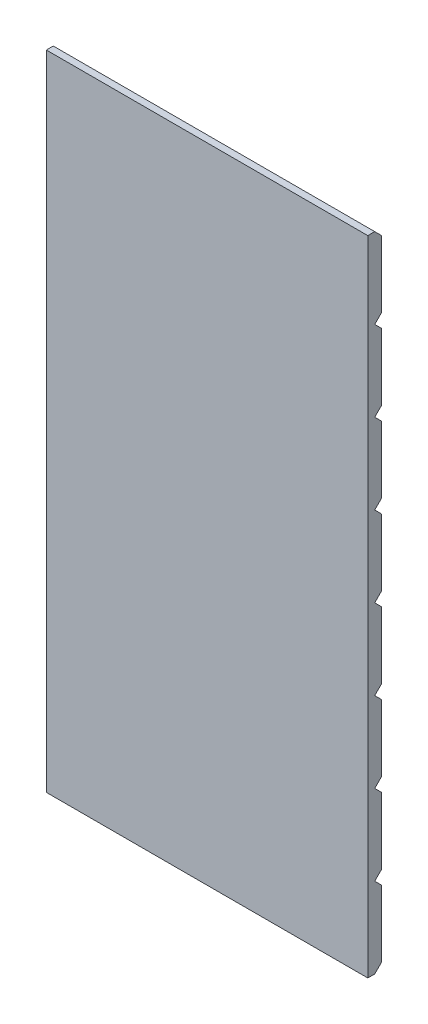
ISO-10303-21;
HEADER;
FILE_DESCRIPTION(('STEP AP214'),'2;1');
FILE_NAME('part.step','',(''),(''),'','','');
FILE_SCHEMA(('AUTOMOTIVE_DESIGN { 1 0 10303 214 1 1 1 1 }'));
ENDSEC;
DATA;
#1=APPLICATION_CONTEXT('core data for automotive mechanical design processes');
#2=APPLICATION_PROTOCOL_DEFINITION('international standard','automotive_design',2000,#1);
#3=PRODUCT_CONTEXT('',#1,'mechanical');
#4=PRODUCT('Part','Part','',(#3));
#5=PRODUCT_RELATED_PRODUCT_CATEGORY('part','',(#4));
#6=PRODUCT_DEFINITION_FORMATION('','',#4);
#7=PRODUCT_DEFINITION_CONTEXT('part definition',#1,'design');
#8=PRODUCT_DEFINITION('design','',#6,#7);
#9=PRODUCT_DEFINITION_SHAPE('','',#8);
#10=(LENGTH_UNIT() NAMED_UNIT(*) SI_UNIT(.MILLI.,.METRE.));
#11=(NAMED_UNIT(*) PLANE_ANGLE_UNIT() SI_UNIT($,.RADIAN.));
#12=(NAMED_UNIT(*) SI_UNIT($,.STERADIAN.) SOLID_ANGLE_UNIT());
#13=UNCERTAINTY_MEASURE_WITH_UNIT(LENGTH_MEASURE(1.E-05),#10,'distance_accuracy_value','');
#14=(GEOMETRIC_REPRESENTATION_CONTEXT(3) GLOBAL_UNCERTAINTY_ASSIGNED_CONTEXT((#13)) GLOBAL_UNIT_ASSIGNED_CONTEXT((#10,
#11,#12)) REPRESENTATION_CONTEXT('',''));
#15=CARTESIAN_POINT('',(0.,0.,0.));
#16=DIRECTION('',(0.,0.,1.));
#17=DIRECTION('',(1.,0.,0.));
#18=AXIS2_PLACEMENT_3D('',#15,#16,#17);
#19=CARTESIAN_POINT('',(0.,0.,0.));
#20=DIRECTION('',(0.,0.,1.));
#21=DIRECTION('',(1.,0.,0.));
#22=AXIS2_PLACEMENT_3D('',#19,#20,#21);
#23=PLANE('',#22);
#24=DIRECTION('',(0.,1.,0.));
#25=VECTOR('',#24,1.);
#26=CARTESIAN_POINT('',(290.,580.,0.));
#27=LINE('',#26,#25);
#28=CARTESIAN_POINT('',(290.,-567.5,0.));
#29=VERTEX_POINT('',#28);
#30=CARTESIAN_POINT('',(290.,-447.5,0.));
#31=VERTEX_POINT('',#30);
#32=EDGE_CURVE('E273',#29,#31,#27,.T.);
#33=ORIENTED_EDGE('',*,*,#32,.F.);
#34=DIRECTION('',(-1.,0.,0.));
#35=VECTOR('',#34,1.);
#36=CARTESIAN_POINT('',(0.,-567.5,0.));
#37=LINE('',#36,#35);
#38=CARTESIAN_POINT('',(-290.,-567.5,0.));
#39=VERTEX_POINT('',#38);
#40=EDGE_CURVE('E47',#29,#39,#37,.T.);
#41=ORIENTED_EDGE('',*,*,#40,.T.);
#42=DIRECTION('',(0.,-1.,0.));
#43=VECTOR('',#42,1.);
#44=CARTESIAN_POINT('',(-290.,580.,0.));
#45=LINE('',#44,#43);
#46=CARTESIAN_POINT('',(-290.,-447.5,0.));
#47=VERTEX_POINT('',#46);
#48=EDGE_CURVE('E304',#47,#39,#45,.T.);
#49=ORIENTED_EDGE('',*,*,#48,.F.);
#50=DIRECTION('',(1.,0.,0.));
#51=VECTOR('',#50,1.);
#52=CARTESIAN_POINT('',(0.,-447.5,0.));
#53=LINE('',#52,#51);
#54=EDGE_CURVE('E391',#47,#31,#53,.T.);
#55=ORIENTED_EDGE('',*,*,#54,.T.);
#56=EDGE_LOOP('',(#33,#41,#49,#55));
#57=FACE_BOUND('',#56,.T.);
#58=ADVANCED_FACE('F32',(#57),#23,.F.);
#59=CARTESIAN_POINT('',(290.,-422.5,0.));
#60=VERTEX_POINT('',#59);
#61=CARTESIAN_POINT('',(290.,-302.5,0.));
#62=VERTEX_POINT('',#61);
#63=EDGE_CURVE('E261',#60,#62,#27,.T.);
#64=ORIENTED_EDGE('',*,*,#63,.F.);
#65=DIRECTION('',(-1.,0.,0.));
#66=VECTOR('',#65,1.);
#67=CARTESIAN_POINT('',(0.,-422.5,0.));
#68=LINE('',#67,#66);
#69=CARTESIAN_POINT('',(-290.,-422.5,0.));
#70=VERTEX_POINT('',#69);
#71=EDGE_CURVE('E54',#60,#70,#68,.T.);
#72=ORIENTED_EDGE('',*,*,#71,.T.);
#73=CARTESIAN_POINT('',(-290.,-302.5,0.));
#74=VERTEX_POINT('',#73);
#75=EDGE_CURVE('E410',#74,#70,#45,.T.);
#76=ORIENTED_EDGE('',*,*,#75,.F.);
#77=DIRECTION('',(1.,0.,0.));
#78=VECTOR('',#77,1.);
#79=CARTESIAN_POINT('',(0.,-302.5,0.));
#80=LINE('',#79,#78);
#81=EDGE_CURVE('E272',#74,#62,#80,.T.);
#82=ORIENTED_EDGE('',*,*,#81,.T.);
#83=EDGE_LOOP('',(#64,#72,#76,#82));
#84=FACE_BOUND('',#83,.T.);
#85=ADVANCED_FACE('F269',(#84),#23,.F.);
#86=CARTESIAN_POINT('',(290.,-277.5,0.));
#87=VERTEX_POINT('',#86);
#88=CARTESIAN_POINT('',(290.,-157.5,0.));
#89=VERTEX_POINT('',#88);
#90=EDGE_CURVE('E274',#87,#89,#27,.T.);
#91=ORIENTED_EDGE('',*,*,#90,.F.);
#92=DIRECTION('',(-1.,0.,0.));
#93=VECTOR('',#92,1.);
#94=CARTESIAN_POINT('',(0.,-277.5,0.));
#95=LINE('',#94,#93);
#96=CARTESIAN_POINT('',(-290.,-277.5,0.));
#97=VERTEX_POINT('',#96);
#98=EDGE_CURVE('E381',#87,#97,#95,.T.);
#99=ORIENTED_EDGE('',*,*,#98,.T.);
#100=CARTESIAN_POINT('',(-290.,-157.5,0.));
#101=VERTEX_POINT('',#100);
#102=EDGE_CURVE('E411',#101,#97,#45,.T.);
#103=ORIENTED_EDGE('',*,*,#102,.F.);
#104=DIRECTION('',(1.,0.,0.));
#105=VECTOR('',#104,1.);
#106=CARTESIAN_POINT('',(0.,-157.5,0.));
#107=LINE('',#106,#105);
#108=EDGE_CURVE('E362',#101,#89,#107,.T.);
#109=ORIENTED_EDGE('',*,*,#108,.T.);
#110=EDGE_LOOP('',(#91,#99,#103,#109));
#111=FACE_BOUND('',#110,.T.);
#112=ADVANCED_FACE('F443',(#111),#23,.F.);
#113=CARTESIAN_POINT('',(290.,-132.5,0.));
#114=VERTEX_POINT('',#113);
#115=CARTESIAN_POINT('',(290.,-12.4999999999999,0.));
#116=VERTEX_POINT('',#115);
#117=EDGE_CURVE('E278',#114,#116,#27,.T.);
#118=ORIENTED_EDGE('',*,*,#117,.F.);
#119=DIRECTION('',(-1.,0.,0.));
#120=VECTOR('',#119,1.);
#121=CARTESIAN_POINT('',(0.,-132.5,0.));
#122=LINE('',#121,#120);
#123=CARTESIAN_POINT('',(-290.,-132.5,0.));
#124=VERTEX_POINT('',#123);
#125=EDGE_CURVE('E367',#114,#124,#122,.T.);
#126=ORIENTED_EDGE('',*,*,#125,.T.);
#127=CARTESIAN_POINT('',(-290.,-12.4999999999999,0.));
#128=VERTEX_POINT('',#127);
#129=EDGE_CURVE('E428',#128,#124,#45,.T.);
#130=ORIENTED_EDGE('',*,*,#129,.F.);
#131=DIRECTION('',(1.,0.,0.));
#132=VECTOR('',#131,1.);
#133=CARTESIAN_POINT('',(0.,-12.5,0.));
#134=LINE('',#133,#132);
#135=EDGE_CURVE('E346',#128,#116,#134,.T.);
#136=ORIENTED_EDGE('',*,*,#135,.T.);
#137=EDGE_LOOP('',(#118,#126,#130,#136));
#138=FACE_BOUND('',#137,.T.);
#139=ADVANCED_FACE('F506',(#138),#23,.F.);
#140=CARTESIAN_POINT('',(290.,12.5,0.));
#141=VERTEX_POINT('',#140);
#142=CARTESIAN_POINT('',(290.,132.5,0.));
#143=VERTEX_POINT('',#142);
#144=EDGE_CURVE('E495',#141,#143,#27,.T.);
#145=ORIENTED_EDGE('',*,*,#144,.F.);
#146=DIRECTION('',(-1.,0.,0.));
#147=VECTOR('',#146,1.);
#148=CARTESIAN_POINT('',(0.,12.5,0.));
#149=LINE('',#148,#147);
#150=CARTESIAN_POINT('',(-290.,12.4999999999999,0.));
#151=VERTEX_POINT('',#150);
#152=EDGE_CURVE('E351',#141,#151,#149,.T.);
#153=ORIENTED_EDGE('',*,*,#152,.T.);
#154=CARTESIAN_POINT('',(-290.,132.5,0.));
#155=VERTEX_POINT('',#154);
#156=EDGE_CURVE('E423',#155,#151,#45,.T.);
#157=ORIENTED_EDGE('',*,*,#156,.F.);
#158=DIRECTION('',(1.,0.,0.));
#159=VECTOR('',#158,1.);
#160=CARTESIAN_POINT('',(0.,132.5,0.));
#161=LINE('',#160,#159);
#162=EDGE_CURVE('E330',#155,#143,#161,.T.);
#163=ORIENTED_EDGE('',*,*,#162,.T.);
#164=EDGE_LOOP('',(#145,#153,#157,#163));
#165=FACE_BOUND('',#164,.T.);
#166=ADVANCED_FACE('F490',(#165),#23,.F.);
#167=CARTESIAN_POINT('',(290.,157.5,0.));
#168=VERTEX_POINT('',#167);
#169=CARTESIAN_POINT('',(290.,277.5,0.));
#170=VERTEX_POINT('',#169);
#171=EDGE_CURVE('E494',#168,#170,#27,.T.);
#172=ORIENTED_EDGE('',*,*,#171,.F.);
#173=DIRECTION('',(-1.,0.,0.));
#174=VECTOR('',#173,1.);
#175=CARTESIAN_POINT('',(0.,157.5,0.));
#176=LINE('',#175,#174);
#177=CARTESIAN_POINT('',(-290.,157.5,0.));
#178=VERTEX_POINT('',#177);
#179=EDGE_CURVE('E335',#168,#178,#176,.T.);
#180=ORIENTED_EDGE('',*,*,#179,.T.);
#181=CARTESIAN_POINT('',(-290.,277.5,0.));
#182=VERTEX_POINT('',#181);
#183=EDGE_CURVE('E418',#182,#178,#45,.T.);
#184=ORIENTED_EDGE('',*,*,#183,.F.);
#185=DIRECTION('',(1.,0.,0.));
#186=VECTOR('',#185,1.);
#187=CARTESIAN_POINT('',(0.,277.5,0.));
#188=LINE('',#187,#186);
#189=EDGE_CURVE('E314',#182,#170,#188,.T.);
#190=ORIENTED_EDGE('',*,*,#189,.T.);
#191=EDGE_LOOP('',(#172,#180,#184,#190));
#192=FACE_BOUND('',#191,.T.);
#193=ADVANCED_FACE('F484',(#192),#23,.F.);
#194=CARTESIAN_POINT('',(290.,302.5,0.));
#195=VERTEX_POINT('',#194);
#196=CARTESIAN_POINT('',(290.,422.5,0.));
#197=VERTEX_POINT('',#196);
#198=EDGE_CURVE('E416',#195,#197,#27,.T.);
#199=ORIENTED_EDGE('',*,*,#198,.F.);
#200=DIRECTION('',(-1.,0.,0.));
#201=VECTOR('',#200,1.);
#202=CARTESIAN_POINT('',(0.,302.5,0.));
#203=LINE('',#202,#201);
#204=CARTESIAN_POINT('',(-290.,302.5,0.));
#205=VERTEX_POINT('',#204);
#206=EDGE_CURVE('E319',#195,#205,#203,.T.);
#207=ORIENTED_EDGE('',*,*,#206,.T.);
#208=CARTESIAN_POINT('',(-290.,422.5,0.));
#209=VERTEX_POINT('',#208);
#210=EDGE_CURVE('E413',#209,#205,#45,.T.);
#211=ORIENTED_EDGE('',*,*,#210,.F.);
#212=DIRECTION('',(1.,0.,0.));
#213=VECTOR('',#212,1.);
#214=CARTESIAN_POINT('',(0.,422.5,0.));
#215=LINE('',#214,#213);
#216=EDGE_CURVE('E241',#209,#197,#215,.T.);
#217=ORIENTED_EDGE('',*,*,#216,.T.);
#218=EDGE_LOOP('',(#199,#207,#211,#217));
#219=FACE_BOUND('',#218,.T.);
#220=ADVANCED_FACE('F473',(#219),#23,.F.);
#221=CARTESIAN_POINT('',(-290.,580.,25.));
#222=DIRECTION('',(1.,0.,0.));
#223=DIRECTION('',(0.,0.,-1.));
#224=AXIS2_PLACEMENT_3D('',#221,#222,#223);
#225=PLANE('',#224);
#226=ORIENTED_EDGE('',*,*,#48,.T.);
#227=DIRECTION('',(0.,0.707106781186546,-0.707106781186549));
#228=VECTOR('',#227,1.);
#229=CARTESIAN_POINT('',(-290.,-580.,12.5));
#230=LINE('',#229,#228);
#231=CARTESIAN_POINT('',(-290.,-580.,12.5));
#232=VERTEX_POINT('',#231);
#233=EDGE_CURVE('E222',#232,#39,#230,.T.);
#234=ORIENTED_EDGE('',*,*,#233,.F.);
#235=DIRECTION('',(0.,0.,-1.));
#236=VECTOR('',#235,1.);
#237=CARTESIAN_POINT('',(-290.,-580.,25.));
#238=LINE('',#237,#236);
#239=CARTESIAN_POINT('',(-290.,-580.,25.));
#240=VERTEX_POINT('',#239);
#241=EDGE_CURVE('E221',#240,#232,#238,.T.);
#242=ORIENTED_EDGE('',*,*,#241,.F.);
#243=DIRECTION('',(0.,-1.,0.));
#244=VECTOR('',#243,1.);
#245=CARTESIAN_POINT('',(-290.,580.,25.));
#246=LINE('',#245,#244);
#247=CARTESIAN_POINT('',(-290.,580.,25.));
#248=VERTEX_POINT('',#247);
#249=EDGE_CURVE('E276',#248,#240,#246,.T.);
#250=ORIENTED_EDGE('',*,*,#249,.F.);
#251=DIRECTION('',(0.,0.,-1.));
#252=VECTOR('',#251,1.);
#253=CARTESIAN_POINT('',(-290.,580.,25.));
#254=LINE('',#253,#252);
#255=CARTESIAN_POINT('',(-290.,580.,12.5));
#256=VERTEX_POINT('',#255);
#257=EDGE_CURVE('E232',#248,#256,#254,.T.);
#258=ORIENTED_EDGE('',*,*,#257,.T.);
#259=DIRECTION('',(0.,0.707106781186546,0.707106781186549));
#260=VECTOR('',#259,1.);
#261=CARTESIAN_POINT('',(-290.,518.918540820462,-48.5814591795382));
#262=LINE('',#261,#260);
#263=CARTESIAN_POINT('',(-290.,567.5,0.));
#264=VERTEX_POINT('',#263);
#265=EDGE_CURVE('E298',#264,#256,#262,.T.);
#266=ORIENTED_EDGE('',*,*,#265,.F.);
#267=CARTESIAN_POINT('',(-290.,447.5,0.));
#268=VERTEX_POINT('',#267);
#269=EDGE_CURVE('E280',#264,#268,#45,.T.);
#270=ORIENTED_EDGE('',*,*,#269,.T.);
#271=DIRECTION('',(0.,0.707106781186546,-0.707106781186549));
#272=VECTOR('',#271,1.);
#273=CARTESIAN_POINT('',(-290.,435.,12.5));
#274=LINE('',#273,#272);
#275=CARTESIAN_POINT('',(-290.,435.,12.5));
#276=VERTEX_POINT('',#275);
#277=EDGE_CURVE('E308',#276,#268,#274,.T.);
#278=ORIENTED_EDGE('',*,*,#277,.F.);
#279=DIRECTION('',(0.,0.707106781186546,0.707106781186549));
#280=VECTOR('',#279,1.);
#281=CARTESIAN_POINT('',(-290.,373.918540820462,-48.5814591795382));
#282=LINE('',#281,#280);
#283=EDGE_CURVE('E302',#209,#276,#282,.T.);
#284=ORIENTED_EDGE('',*,*,#283,.F.);
#285=ORIENTED_EDGE('',*,*,#210,.T.);
#286=DIRECTION('',(0.,0.707106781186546,-0.707106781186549));
#287=VECTOR('',#286,1.);
#288=CARTESIAN_POINT('',(-290.,290.,12.5));
#289=LINE('',#288,#287);
#290=CARTESIAN_POINT('',(-290.,290.,12.5));
#291=VERTEX_POINT('',#290);
#292=EDGE_CURVE('E326',#291,#205,#289,.T.);
#293=ORIENTED_EDGE('',*,*,#292,.F.);
#294=DIRECTION('',(0.,0.707106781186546,0.707106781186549));
#295=VECTOR('',#294,1.);
#296=CARTESIAN_POINT('',(-290.,228.918540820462,-48.5814591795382));
#297=LINE('',#296,#295);
#298=EDGE_CURVE('E322',#182,#291,#297,.T.);
#299=ORIENTED_EDGE('',*,*,#298,.F.);
#300=ORIENTED_EDGE('',*,*,#183,.T.);
#301=DIRECTION('',(0.,0.707106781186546,-0.707106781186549));
#302=VECTOR('',#301,1.);
#303=CARTESIAN_POINT('',(-290.,145.,12.5));
#304=LINE('',#303,#302);
#305=CARTESIAN_POINT('',(-290.,145.,12.5));
#306=VERTEX_POINT('',#305);
#307=EDGE_CURVE('E342',#306,#178,#304,.T.);
#308=ORIENTED_EDGE('',*,*,#307,.F.);
#309=DIRECTION('',(0.,0.707106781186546,0.707106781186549));
#310=VECTOR('',#309,1.);
#311=CARTESIAN_POINT('',(-290.,83.918540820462,-48.5814591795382));
#312=LINE('',#311,#310);
#313=EDGE_CURVE('E338',#155,#306,#312,.T.);
#314=ORIENTED_EDGE('',*,*,#313,.F.);
#315=ORIENTED_EDGE('',*,*,#156,.T.);
#316=DIRECTION('',(0.,0.707106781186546,-0.707106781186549));
#317=VECTOR('',#316,1.);
#318=CARTESIAN_POINT('',(-290.,0.,12.5));
#319=LINE('',#318,#317);
#320=CARTESIAN_POINT('',(-290.,0.,12.5));
#321=VERTEX_POINT('',#320);
#322=EDGE_CURVE('E358',#321,#151,#319,.T.);
#323=ORIENTED_EDGE('',*,*,#322,.F.);
#324=DIRECTION('',(0.,0.707106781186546,0.707106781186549));
#325=VECTOR('',#324,1.);
#326=CARTESIAN_POINT('',(-290.,-61.081459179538,-48.5814591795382));
#327=LINE('',#326,#325);
#328=EDGE_CURVE('E354',#128,#321,#327,.T.);
#329=ORIENTED_EDGE('',*,*,#328,.F.);
#330=ORIENTED_EDGE('',*,*,#129,.T.);
#331=DIRECTION('',(0.,0.707106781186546,-0.707106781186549));
#332=VECTOR('',#331,1.);
#333=CARTESIAN_POINT('',(-290.,-145.,12.5));
#334=LINE('',#333,#332);
#335=CARTESIAN_POINT('',(-290.,-145.,12.5));
#336=VERTEX_POINT('',#335);
#337=EDGE_CURVE('E374',#336,#124,#334,.T.);
#338=ORIENTED_EDGE('',*,*,#337,.F.);
#339=DIRECTION('',(0.,0.707106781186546,0.707106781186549));
#340=VECTOR('',#339,1.);
#341=CARTESIAN_POINT('',(-290.,-206.081459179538,-48.5814591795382));
#342=LINE('',#341,#340);
#343=EDGE_CURVE('E370',#101,#336,#342,.T.);
#344=ORIENTED_EDGE('',*,*,#343,.F.);
#345=ORIENTED_EDGE('',*,*,#102,.T.);
#346=DIRECTION('',(0.,0.707106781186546,-0.707106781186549));
#347=VECTOR('',#346,1.);
#348=CARTESIAN_POINT('',(-290.,-290.,12.5));
#349=LINE('',#348,#347);
#350=CARTESIAN_POINT('',(-290.,-290.,12.5));
#351=VERTEX_POINT('',#350);
#352=EDGE_CURVE('E388',#351,#97,#349,.T.);
#353=ORIENTED_EDGE('',*,*,#352,.F.);
#354=DIRECTION('',(0.,0.707106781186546,0.707106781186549));
#355=VECTOR('',#354,1.);
#356=CARTESIAN_POINT('',(-290.,-351.081459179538,-48.5814591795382));
#357=LINE('',#356,#355);
#358=EDGE_CURVE('E384',#74,#351,#357,.T.);
#359=ORIENTED_EDGE('',*,*,#358,.F.);
#360=ORIENTED_EDGE('',*,*,#75,.T.);
#361=DIRECTION('',(0.,0.707106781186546,-0.707106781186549));
#362=VECTOR('',#361,1.);
#363=CARTESIAN_POINT('',(-290.,-435.,12.5));
#364=LINE('',#363,#362);
#365=CARTESIAN_POINT('',(-290.,-435.,12.5));
#366=VERTEX_POINT('',#365);
#367=EDGE_CURVE('E400',#366,#70,#364,.T.);
#368=ORIENTED_EDGE('',*,*,#367,.F.);
#369=DIRECTION('',(0.,0.707106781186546,0.707106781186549));
#370=VECTOR('',#369,1.);
#371=CARTESIAN_POINT('',(-290.,-496.081459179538,-48.5814591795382));
#372=LINE('',#371,#370);
#373=EDGE_CURVE('E397',#47,#366,#372,.T.);
#374=ORIENTED_EDGE('',*,*,#373,.F.);
#375=EDGE_LOOP('',(#226,#234,#242,#250,#258,#266,#270,#278,#284,#285,#293,#299,#300,#308,#314,
#315,#323,#329,#330,#338,#344,#345,#353,#359,#360,#368,#374));
#376=FACE_BOUND('',#375,.T.);
#377=ADVANCED_FACE('F34',(#376),#225,.F.);
#378=CARTESIAN_POINT('',(-290.,-580.,25.));
#379=DIRECTION('',(0.,1.,0.));
#380=DIRECTION('',(0.,0.,1.));
#381=AXIS2_PLACEMENT_3D('',#378,#379,#380);
#382=PLANE('',#381);
#383=ORIENTED_EDGE('',*,*,#241,.T.);
#384=DIRECTION('',(1.,0.,0.));
#385=VECTOR('',#384,1.);
#386=CARTESIAN_POINT('',(-426.582294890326,-580.,12.5));
#387=LINE('',#386,#385);
#388=CARTESIAN_POINT('',(290.,-580.,12.5));
#389=VERTEX_POINT('',#388);
#390=EDGE_CURVE('E209',#232,#389,#387,.T.);
#391=ORIENTED_EDGE('',*,*,#390,.T.);
#392=DIRECTION('',(0.,0.,-1.));
#393=VECTOR('',#392,1.);
#394=CARTESIAN_POINT('',(290.,-580.,25.));
#395=LINE('',#394,#393);
#396=CARTESIAN_POINT('',(290.,-580.,25.));
#397=VERTEX_POINT('',#396);
#398=EDGE_CURVE('E218',#397,#389,#395,.T.);
#399=ORIENTED_EDGE('',*,*,#398,.F.);
#400=DIRECTION('',(1.,0.,0.));
#401=VECTOR('',#400,1.);
#402=CARTESIAN_POINT('',(-290.,-580.,25.));
#403=LINE('',#402,#401);
#404=EDGE_CURVE('E291',#240,#397,#403,.T.);
#405=ORIENTED_EDGE('',*,*,#404,.F.);
#406=EDGE_LOOP('',(#383,#391,#399,#405));
#407=FACE_BOUND('',#406,.T.);
#408=ADVANCED_FACE('F217',(#407),#382,.F.);
#409=CARTESIAN_POINT('',(290.,580.,25.));
#410=DIRECTION('',(-1.,0.,0.));
#411=DIRECTION('',(0.,0.,1.));
#412=AXIS2_PLACEMENT_3D('',#409,#410,#411);
#413=PLANE('',#412);
#414=ORIENTED_EDGE('',*,*,#398,.T.);
#415=DIRECTION('',(0.,0.707106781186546,-0.707106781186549));
#416=VECTOR('',#415,1.);
#417=CARTESIAN_POINT('',(290.,-6.25000000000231,-561.25));
#418=LINE('',#417,#416);
#419=EDGE_CURVE('E11',#389,#29,#418,.T.);
#420=ORIENTED_EDGE('',*,*,#419,.T.);
#421=ORIENTED_EDGE('',*,*,#32,.T.);
#422=DIRECTION('',(0.,-0.707106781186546,-0.707106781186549));
#423=VECTOR('',#422,1.);
#424=CARTESIAN_POINT('',(290.,-496.081459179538,-48.5814591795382));
#425=LINE('',#424,#423);
#426=CARTESIAN_POINT('',(290.,-435.,12.5));
#427=VERTEX_POINT('',#426);
#428=EDGE_CURVE('E264',#427,#31,#425,.T.);
#429=ORIENTED_EDGE('',*,*,#428,.F.);
#430=DIRECTION('',(0.,0.707106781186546,-0.707106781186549));
#431=VECTOR('',#430,1.);
#432=CARTESIAN_POINT('',(290.,66.249999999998,-488.75));
#433=LINE('',#432,#431);
#434=EDGE_CURVE('E40',#427,#60,#433,.T.);
#435=ORIENTED_EDGE('',*,*,#434,.T.);
#436=ORIENTED_EDGE('',*,*,#63,.T.);
#437=DIRECTION('',(0.,-0.707106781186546,-0.707106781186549));
#438=VECTOR('',#437,1.);
#439=CARTESIAN_POINT('',(290.,-351.081459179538,-48.5814591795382));
#440=LINE('',#439,#438);
#441=CARTESIAN_POINT('',(290.,-290.,12.5));
#442=VERTEX_POINT('',#441);
#443=EDGE_CURVE('E389',#442,#62,#440,.T.);
#444=ORIENTED_EDGE('',*,*,#443,.F.);
#445=DIRECTION('',(0.,0.707106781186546,-0.707106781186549));
#446=VECTOR('',#445,1.);
#447=CARTESIAN_POINT('',(290.,138.749999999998,-416.25));
#448=LINE('',#447,#446);
#449=EDGE_CURVE('E256',#442,#87,#448,.T.);
#450=ORIENTED_EDGE('',*,*,#449,.T.);
#451=ORIENTED_EDGE('',*,*,#90,.T.);
#452=DIRECTION('',(0.,-0.707106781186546,-0.707106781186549));
#453=VECTOR('',#452,1.);
#454=CARTESIAN_POINT('',(290.,-206.081459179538,-48.5814591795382));
#455=LINE('',#454,#453);
#456=CARTESIAN_POINT('',(290.,-145.,12.5));
#457=VERTEX_POINT('',#456);
#458=EDGE_CURVE('E375',#457,#89,#455,.T.);
#459=ORIENTED_EDGE('',*,*,#458,.F.);
#460=DIRECTION('',(0.,0.707106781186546,-0.707106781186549));
#461=VECTOR('',#460,1.);
#462=CARTESIAN_POINT('',(290.,211.249999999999,-343.75));
#463=LINE('',#462,#461);
#464=EDGE_CURVE('E253',#457,#114,#463,.T.);
#465=ORIENTED_EDGE('',*,*,#464,.T.);
#466=ORIENTED_EDGE('',*,*,#117,.T.);
#467=DIRECTION('',(0.,-0.707106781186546,-0.707106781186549));
#468=VECTOR('',#467,1.);
#469=CARTESIAN_POINT('',(290.,-61.081459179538,-48.5814591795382));
#470=LINE('',#469,#468);
#471=CARTESIAN_POINT('',(290.,0.,12.5));
#472=VERTEX_POINT('',#471);
#473=EDGE_CURVE('E359',#472,#116,#470,.T.);
#474=ORIENTED_EDGE('',*,*,#473,.F.);
#475=DIRECTION('',(0.,0.707106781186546,-0.707106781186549));
#476=VECTOR('',#475,1.);
#477=CARTESIAN_POINT('',(290.,283.749999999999,-271.25));
#478=LINE('',#477,#476);
#479=EDGE_CURVE('E250',#472,#141,#478,.T.);
#480=ORIENTED_EDGE('',*,*,#479,.T.);
#481=ORIENTED_EDGE('',*,*,#144,.T.);
#482=DIRECTION('',(0.,-0.707106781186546,-0.707106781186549));
#483=VECTOR('',#482,1.);
#484=CARTESIAN_POINT('',(290.,83.918540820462,-48.5814591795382));
#485=LINE('',#484,#483);
#486=CARTESIAN_POINT('',(290.,145.,12.5));
#487=VERTEX_POINT('',#486);
#488=EDGE_CURVE('E343',#487,#143,#485,.T.);
#489=ORIENTED_EDGE('',*,*,#488,.F.);
#490=DIRECTION('',(0.,0.707106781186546,-0.707106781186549));
#491=VECTOR('',#490,1.);
#492=CARTESIAN_POINT('',(290.,356.249999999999,-198.75));
#493=LINE('',#492,#491);
#494=EDGE_CURVE('E247',#487,#168,#493,.T.);
#495=ORIENTED_EDGE('',*,*,#494,.T.);
#496=ORIENTED_EDGE('',*,*,#171,.T.);
#497=DIRECTION('',(0.,-0.707106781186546,-0.707106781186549));
#498=VECTOR('',#497,1.);
#499=CARTESIAN_POINT('',(290.,228.918540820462,-48.5814591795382));
#500=LINE('',#499,#498);
#501=CARTESIAN_POINT('',(290.,290.,12.5));
#502=VERTEX_POINT('',#501);
#503=EDGE_CURVE('E327',#502,#170,#500,.T.);
#504=ORIENTED_EDGE('',*,*,#503,.F.);
#505=DIRECTION('',(0.,0.707106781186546,-0.707106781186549));
#506=VECTOR('',#505,1.);
#507=CARTESIAN_POINT('',(290.,428.749999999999,-126.25));
#508=LINE('',#507,#506);
#509=EDGE_CURVE('E244',#502,#195,#508,.T.);
#510=ORIENTED_EDGE('',*,*,#509,.T.);
#511=ORIENTED_EDGE('',*,*,#198,.T.);
#512=DIRECTION('',(0.,-0.707106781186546,-0.707106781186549));
#513=VECTOR('',#512,1.);
#514=CARTESIAN_POINT('',(290.,373.918540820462,-48.5814591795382));
#515=LINE('',#514,#513);
#516=CARTESIAN_POINT('',(290.,435.,12.5));
#517=VERTEX_POINT('',#516);
#518=EDGE_CURVE('E311',#517,#197,#515,.T.);
#519=ORIENTED_EDGE('',*,*,#518,.F.);
#520=DIRECTION('',(0.,-0.707106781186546,0.707106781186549));
#521=VECTOR('',#520,1.);
#522=CARTESIAN_POINT('',(290.,435.,12.5));
#523=LINE('',#522,#521);
#524=CARTESIAN_POINT('',(290.,447.5,0.));
#525=VERTEX_POINT('',#524);
#526=EDGE_CURVE('E309',#525,#517,#523,.T.);
#527=ORIENTED_EDGE('',*,*,#526,.F.);
#528=CARTESIAN_POINT('',(290.,567.5,0.));
#529=VERTEX_POINT('',#528);
#530=EDGE_CURVE('E277',#525,#529,#27,.T.);
#531=ORIENTED_EDGE('',*,*,#530,.T.);
#532=DIRECTION('',(0.,-0.707106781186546,-0.707106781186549));
#533=VECTOR('',#532,1.);
#534=CARTESIAN_POINT('',(290.,518.918540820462,-48.5814591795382));
#535=LINE('',#534,#533);
#536=CARTESIAN_POINT('',(290.,580.,12.5));
#537=VERTEX_POINT('',#536);
#538=EDGE_CURVE('E299',#537,#529,#535,.T.);
#539=ORIENTED_EDGE('',*,*,#538,.F.);
#540=DIRECTION('',(0.,0.,-1.));
#541=VECTOR('',#540,1.);
#542=CARTESIAN_POINT('',(290.,580.,25.));
#543=LINE('',#542,#541);
#544=CARTESIAN_POINT('',(290.,580.,25.));
#545=VERTEX_POINT('',#544);
#546=EDGE_CURVE('E227',#545,#537,#543,.T.);
#547=ORIENTED_EDGE('',*,*,#546,.F.);
#548=DIRECTION('',(0.,1.,0.));
#549=VECTOR('',#548,1.);
#550=CARTESIAN_POINT('',(290.,580.,25.));
#551=LINE('',#550,#549);
#552=EDGE_CURVE('E226',#397,#545,#551,.T.);
#553=ORIENTED_EDGE('',*,*,#552,.F.);
#554=EDGE_LOOP('',(#414,#420,#421,#429,#435,#436,#444,#450,#451,#459,#465,#466,#474,#480,#481,
#489,#495,#496,#504,#510,#511,#519,#527,#531,#539,#547,#553));
#555=FACE_BOUND('',#554,.T.);
#556=ADVANCED_FACE('F224',(#555),#413,.F.);
#557=CARTESIAN_POINT('',(-290.,580.,25.));
#558=DIRECTION('',(0.,-1.,0.));
#559=DIRECTION('',(0.,0.,-1.));
#560=AXIS2_PLACEMENT_3D('',#557,#558,#559);
#561=PLANE('',#560);
#562=ORIENTED_EDGE('',*,*,#546,.T.);
#563=DIRECTION('',(1.,0.,0.));
#564=VECTOR('',#563,1.);
#565=CARTESIAN_POINT('',(-426.582294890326,580.,12.5));
#566=LINE('',#565,#564);
#567=EDGE_CURVE('E296',#256,#537,#566,.T.);
#568=ORIENTED_EDGE('',*,*,#567,.F.);
#569=ORIENTED_EDGE('',*,*,#257,.F.);
#570=DIRECTION('',(-1.,0.,0.));
#571=VECTOR('',#570,1.);
#572=CARTESIAN_POINT('',(-290.,580.,25.));
#573=LINE('',#572,#571);
#574=EDGE_CURVE('E283',#545,#248,#573,.T.);
#575=ORIENTED_EDGE('',*,*,#574,.F.);
#576=EDGE_LOOP('',(#562,#568,#569,#575));
#577=FACE_BOUND('',#576,.T.);
#578=ADVANCED_FACE('F481',(#577),#561,.F.);
#579=CARTESIAN_POINT('',(0.,0.,25.));
#580=DIRECTION('',(0.,0.,1.));
#581=DIRECTION('',(1.,0.,0.));
#582=AXIS2_PLACEMENT_3D('',#579,#580,#581);
#583=PLANE('',#582);
#584=ORIENTED_EDGE('',*,*,#249,.T.);
#585=ORIENTED_EDGE('',*,*,#404,.T.);
#586=ORIENTED_EDGE('',*,*,#552,.T.);
#587=ORIENTED_EDGE('',*,*,#574,.T.);
#588=EDGE_LOOP('',(#584,#585,#586,#587));
#589=FACE_BOUND('',#588,.T.);
#590=ADVANCED_FACE('F471',(#589),#583,.T.);
#591=ORIENTED_EDGE('',*,*,#530,.F.);
#592=DIRECTION('',(-1.,0.,0.));
#593=VECTOR('',#592,1.);
#594=CARTESIAN_POINT('',(0.,447.5,0.));
#595=LINE('',#594,#593);
#596=EDGE_CURVE('E238',#525,#268,#595,.T.);
#597=ORIENTED_EDGE('',*,*,#596,.T.);
#598=ORIENTED_EDGE('',*,*,#269,.F.);
#599=DIRECTION('',(1.,0.,0.));
#600=VECTOR('',#599,1.);
#601=CARTESIAN_POINT('',(0.,567.5,0.));
#602=LINE('',#601,#600);
#603=EDGE_CURVE('E229',#264,#529,#602,.T.);
#604=ORIENTED_EDGE('',*,*,#603,.T.);
#605=EDGE_LOOP('',(#591,#597,#598,#604));
#606=FACE_BOUND('',#605,.T.);
#607=ADVANCED_FACE('F463',(#606),#23,.F.);
#608=CARTESIAN_POINT('',(-426.582294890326,518.918540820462,-48.5814591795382));
#609=DIRECTION('',(0.,-0.707106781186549,0.707106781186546));
#610=DIRECTION('',(0.,-0.707106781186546,-0.707106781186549));
#611=AXIS2_PLACEMENT_3D('',#608,#609,#610);
#612=PLANE('',#611);
#613=ORIENTED_EDGE('',*,*,#265,.T.);
#614=ORIENTED_EDGE('',*,*,#567,.T.);
#615=ORIENTED_EDGE('',*,*,#538,.T.);
#616=ORIENTED_EDGE('',*,*,#603,.F.);
#617=EDGE_LOOP('',(#613,#614,#615,#616));
#618=FACE_BOUND('',#617,.T.);
#619=ADVANCED_FACE('F470',(#618),#612,.F.);
#620=CARTESIAN_POINT('',(-426.582294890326,373.918540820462,-48.5814591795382));
#621=DIRECTION('',(0.,-0.707106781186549,0.707106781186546));
#622=DIRECTION('',(0.,-0.707106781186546,-0.707106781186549));
#623=AXIS2_PLACEMENT_3D('',#620,#621,#622);
#624=PLANE('',#623);
#625=ORIENTED_EDGE('',*,*,#283,.T.);
#626=DIRECTION('',(1.,0.,0.));
#627=VECTOR('',#626,1.);
#628=CARTESIAN_POINT('',(-426.582294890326,435.,12.5));
#629=LINE('',#628,#627);
#630=EDGE_CURVE('E305',#276,#517,#629,.T.);
#631=ORIENTED_EDGE('',*,*,#630,.T.);
#632=ORIENTED_EDGE('',*,*,#518,.T.);
#633=ORIENTED_EDGE('',*,*,#216,.F.);
#634=EDGE_LOOP('',(#625,#631,#632,#633));
#635=FACE_BOUND('',#634,.T.);
#636=ADVANCED_FACE('F478',(#635),#624,.F.);
#637=CARTESIAN_POINT('',(-426.582294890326,435.,12.5));
#638=DIRECTION('',(0.,0.707106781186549,0.707106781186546));
#639=DIRECTION('',(0.,-0.707106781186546,0.707106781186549));
#640=AXIS2_PLACEMENT_3D('',#637,#638,#639);
#641=PLANE('',#640);
#642=ORIENTED_EDGE('',*,*,#526,.T.);
#643=ORIENTED_EDGE('',*,*,#630,.F.);
#644=ORIENTED_EDGE('',*,*,#277,.T.);
#645=ORIENTED_EDGE('',*,*,#596,.F.);
#646=EDGE_LOOP('',(#642,#643,#644,#645));
#647=FACE_BOUND('',#646,.T.);
#648=ADVANCED_FACE('F541',(#647),#641,.F.);
#649=CARTESIAN_POINT('',(-426.582294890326,228.918540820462,-48.5814591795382));
#650=DIRECTION('',(0.,-0.707106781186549,0.707106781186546));
#651=DIRECTION('',(0.,-0.707106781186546,-0.707106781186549));
#652=AXIS2_PLACEMENT_3D('',#649,#650,#651);
#653=PLANE('',#652);
#654=ORIENTED_EDGE('',*,*,#298,.T.);
#655=DIRECTION('',(1.,0.,0.));
#656=VECTOR('',#655,1.);
#657=CARTESIAN_POINT('',(-426.582294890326,290.,12.5));
#658=LINE('',#657,#656);
#659=EDGE_CURVE('E323',#291,#502,#658,.T.);
#660=ORIENTED_EDGE('',*,*,#659,.T.);
#661=ORIENTED_EDGE('',*,*,#503,.T.);
#662=ORIENTED_EDGE('',*,*,#189,.F.);
#663=EDGE_LOOP('',(#654,#660,#661,#662));
#664=FACE_BOUND('',#663,.T.);
#665=ADVANCED_FACE('F537',(#664),#653,.F.);
#666=CARTESIAN_POINT('',(-426.582294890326,290.,12.5));
#667=DIRECTION('',(0.,0.707106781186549,0.707106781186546));
#668=DIRECTION('',(0.,-0.707106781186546,0.707106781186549));
#669=AXIS2_PLACEMENT_3D('',#666,#667,#668);
#670=PLANE('',#669);
#671=ORIENTED_EDGE('',*,*,#509,.F.);
#672=ORIENTED_EDGE('',*,*,#659,.F.);
#673=ORIENTED_EDGE('',*,*,#292,.T.);
#674=ORIENTED_EDGE('',*,*,#206,.F.);
#675=EDGE_LOOP('',(#671,#672,#673,#674));
#676=FACE_BOUND('',#675,.T.);
#677=ADVANCED_FACE('F533',(#676),#670,.F.);
#678=CARTESIAN_POINT('',(-426.582294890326,83.918540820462,-48.5814591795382));
#679=DIRECTION('',(0.,-0.707106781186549,0.707106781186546));
#680=DIRECTION('',(0.,-0.707106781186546,-0.707106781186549));
#681=AXIS2_PLACEMENT_3D('',#678,#679,#680);
#682=PLANE('',#681);
#683=ORIENTED_EDGE('',*,*,#313,.T.);
#684=DIRECTION('',(1.,0.,0.));
#685=VECTOR('',#684,1.);
#686=CARTESIAN_POINT('',(-426.582294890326,145.,12.5));
#687=LINE('',#686,#685);
#688=EDGE_CURVE('E339',#306,#487,#687,.T.);
#689=ORIENTED_EDGE('',*,*,#688,.T.);
#690=ORIENTED_EDGE('',*,*,#488,.T.);
#691=ORIENTED_EDGE('',*,*,#162,.F.);
#692=EDGE_LOOP('',(#683,#689,#690,#691));
#693=FACE_BOUND('',#692,.T.);
#694=ADVANCED_FACE('F529',(#693),#682,.F.);
#695=CARTESIAN_POINT('',(-426.582294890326,145.,12.5));
#696=DIRECTION('',(0.,0.707106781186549,0.707106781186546));
#697=DIRECTION('',(0.,-0.707106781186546,0.707106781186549));
#698=AXIS2_PLACEMENT_3D('',#695,#696,#697);
#699=PLANE('',#698);
#700=ORIENTED_EDGE('',*,*,#494,.F.);
#701=ORIENTED_EDGE('',*,*,#688,.F.);
#702=ORIENTED_EDGE('',*,*,#307,.T.);
#703=ORIENTED_EDGE('',*,*,#179,.F.);
#704=EDGE_LOOP('',(#700,#701,#702,#703));
#705=FACE_BOUND('',#704,.T.);
#706=ADVANCED_FACE('F526',(#705),#699,.F.);
#707=CARTESIAN_POINT('',(-426.582294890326,-61.081459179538,-48.5814591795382));
#708=DIRECTION('',(0.,-0.707106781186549,0.707106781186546));
#709=DIRECTION('',(0.,-0.707106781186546,-0.707106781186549));
#710=AXIS2_PLACEMENT_3D('',#707,#708,#709);
#711=PLANE('',#710);
#712=ORIENTED_EDGE('',*,*,#328,.T.);
#713=DIRECTION('',(1.,0.,0.));
#714=VECTOR('',#713,1.);
#715=CARTESIAN_POINT('',(-426.582294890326,0.,12.5));
#716=LINE('',#715,#714);
#717=EDGE_CURVE('E355',#321,#472,#716,.T.);
#718=ORIENTED_EDGE('',*,*,#717,.T.);
#719=ORIENTED_EDGE('',*,*,#473,.T.);
#720=ORIENTED_EDGE('',*,*,#135,.F.);
#721=EDGE_LOOP('',(#712,#718,#719,#720));
#722=FACE_BOUND('',#721,.T.);
#723=ADVANCED_FACE('F504',(#722),#711,.F.);
#724=CARTESIAN_POINT('',(-426.582294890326,0.,12.5));
#725=DIRECTION('',(0.,0.707106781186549,0.707106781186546));
#726=DIRECTION('',(0.,-0.707106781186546,0.707106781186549));
#727=AXIS2_PLACEMENT_3D('',#724,#725,#726);
#728=PLANE('',#727);
#729=ORIENTED_EDGE('',*,*,#479,.F.);
#730=ORIENTED_EDGE('',*,*,#717,.F.);
#731=ORIENTED_EDGE('',*,*,#322,.T.);
#732=ORIENTED_EDGE('',*,*,#152,.F.);
#733=EDGE_LOOP('',(#729,#730,#731,#732));
#734=FACE_BOUND('',#733,.T.);
#735=ADVANCED_FACE('F513',(#734),#728,.F.);
#736=CARTESIAN_POINT('',(-426.582294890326,-206.081459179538,-48.5814591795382));
#737=DIRECTION('',(0.,-0.707106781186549,0.707106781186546));
#738=DIRECTION('',(0.,-0.707106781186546,-0.707106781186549));
#739=AXIS2_PLACEMENT_3D('',#736,#737,#738);
#740=PLANE('',#739);
#741=ORIENTED_EDGE('',*,*,#343,.T.);
#742=DIRECTION('',(1.,0.,0.));
#743=VECTOR('',#742,1.);
#744=CARTESIAN_POINT('',(-426.582294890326,-145.,12.5));
#745=LINE('',#744,#743);
#746=EDGE_CURVE('E371',#336,#457,#745,.T.);
#747=ORIENTED_EDGE('',*,*,#746,.T.);
#748=ORIENTED_EDGE('',*,*,#458,.T.);
#749=ORIENTED_EDGE('',*,*,#108,.F.);
#750=EDGE_LOOP('',(#741,#747,#748,#749));
#751=FACE_BOUND('',#750,.T.);
#752=ADVANCED_FACE('F511',(#751),#740,.F.);
#753=CARTESIAN_POINT('',(-426.582294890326,-145.,12.5));
#754=DIRECTION('',(0.,0.707106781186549,0.707106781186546));
#755=DIRECTION('',(0.,-0.707106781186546,0.707106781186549));
#756=AXIS2_PLACEMENT_3D('',#753,#754,#755);
#757=PLANE('',#756);
#758=ORIENTED_EDGE('',*,*,#464,.F.);
#759=ORIENTED_EDGE('',*,*,#746,.F.);
#760=ORIENTED_EDGE('',*,*,#337,.T.);
#761=ORIENTED_EDGE('',*,*,#125,.F.);
#762=EDGE_LOOP('',(#758,#759,#760,#761));
#763=FACE_BOUND('',#762,.T.);
#764=ADVANCED_FACE('F508',(#763),#757,.F.);
#765=CARTESIAN_POINT('',(-426.582294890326,-351.081459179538,-48.5814591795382));
#766=DIRECTION('',(0.,-0.707106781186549,0.707106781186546));
#767=DIRECTION('',(0.,-0.707106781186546,-0.707106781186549));
#768=AXIS2_PLACEMENT_3D('',#765,#766,#767);
#769=PLANE('',#768);
#770=ORIENTED_EDGE('',*,*,#358,.T.);
#771=DIRECTION('',(1.,0.,0.));
#772=VECTOR('',#771,1.);
#773=CARTESIAN_POINT('',(-426.582294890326,-290.,12.5));
#774=LINE('',#773,#772);
#775=EDGE_CURVE('E385',#351,#442,#774,.T.);
#776=ORIENTED_EDGE('',*,*,#775,.T.);
#777=ORIENTED_EDGE('',*,*,#443,.T.);
#778=ORIENTED_EDGE('',*,*,#81,.F.);
#779=EDGE_LOOP('',(#770,#776,#777,#778));
#780=FACE_BOUND('',#779,.T.);
#781=ADVANCED_FACE('F449',(#780),#769,.F.);
#782=CARTESIAN_POINT('',(-426.582294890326,-290.,12.5));
#783=DIRECTION('',(0.,0.707106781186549,0.707106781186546));
#784=DIRECTION('',(0.,-0.707106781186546,0.707106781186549));
#785=AXIS2_PLACEMENT_3D('',#782,#783,#784);
#786=PLANE('',#785);
#787=ORIENTED_EDGE('',*,*,#449,.F.);
#788=ORIENTED_EDGE('',*,*,#775,.F.);
#789=ORIENTED_EDGE('',*,*,#352,.T.);
#790=ORIENTED_EDGE('',*,*,#98,.F.);
#791=EDGE_LOOP('',(#787,#788,#789,#790));
#792=FACE_BOUND('',#791,.T.);
#793=ADVANCED_FACE('F445',(#792),#786,.F.);
#794=CARTESIAN_POINT('',(-426.582294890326,-496.081459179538,-48.5814591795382));
#795=DIRECTION('',(0.,-0.707106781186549,0.707106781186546));
#796=DIRECTION('',(0.,-0.707106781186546,-0.707106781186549));
#797=AXIS2_PLACEMENT_3D('',#794,#795,#796);
#798=PLANE('',#797);
#799=ORIENTED_EDGE('',*,*,#373,.T.);
#800=DIRECTION('',(1.,0.,0.));
#801=VECTOR('',#800,1.);
#802=CARTESIAN_POINT('',(-426.582294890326,-435.,12.5));
#803=LINE('',#802,#801);
#804=EDGE_CURVE('E398',#366,#427,#803,.T.);
#805=ORIENTED_EDGE('',*,*,#804,.T.);
#806=ORIENTED_EDGE('',*,*,#428,.T.);
#807=ORIENTED_EDGE('',*,*,#54,.F.);
#808=EDGE_LOOP('',(#799,#805,#806,#807));
#809=FACE_BOUND('',#808,.T.);
#810=ADVANCED_FACE('F452',(#809),#798,.F.);
#811=CARTESIAN_POINT('',(-426.582294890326,-435.,12.5));
#812=DIRECTION('',(0.,0.707106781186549,0.707106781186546));
#813=DIRECTION('',(0.,-0.707106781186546,0.707106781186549));
#814=AXIS2_PLACEMENT_3D('',#811,#812,#813);
#815=PLANE('',#814);
#816=ORIENTED_EDGE('',*,*,#434,.F.);
#817=ORIENTED_EDGE('',*,*,#804,.F.);
#818=ORIENTED_EDGE('',*,*,#367,.T.);
#819=ORIENTED_EDGE('',*,*,#71,.F.);
#820=EDGE_LOOP('',(#816,#817,#818,#819));
#821=FACE_BOUND('',#820,.T.);
#822=ADVANCED_FACE('F450',(#821),#815,.F.);
#823=CARTESIAN_POINT('',(-426.582294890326,-580.,12.5));
#824=DIRECTION('',(0.,0.707106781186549,0.707106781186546));
#825=DIRECTION('',(0.,-0.707106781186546,0.707106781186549));
#826=AXIS2_PLACEMENT_3D('',#823,#824,#825);
#827=PLANE('',#826);
#828=ORIENTED_EDGE('',*,*,#419,.F.);
#829=ORIENTED_EDGE('',*,*,#390,.F.);
#830=ORIENTED_EDGE('',*,*,#233,.T.);
#831=ORIENTED_EDGE('',*,*,#40,.F.);
#832=EDGE_LOOP('',(#828,#829,#830,#831));
#833=FACE_BOUND('',#832,.T.);
#834=ADVANCED_FACE('F208',(#833),#827,.F.);
#835=CLOSED_SHELL('',(#58,#85,#112,#139,#166,#193,#220,#377,#408,#556,#578,#590,#607,#619,#636,
#648,#665,#677,#694,#706,#723,#735,#752,#764,#781,#793,#810,#822,#834));
#836=MANIFOLD_SOLID_BREP('B2',#835);
#837=ADVANCED_BREP_SHAPE_REPRESENTATION('',(#18,#836),#14);
#838=SHAPE_DEFINITION_REPRESENTATION(#9,#837);
ENDSEC;
END-ISO-10303-21;
